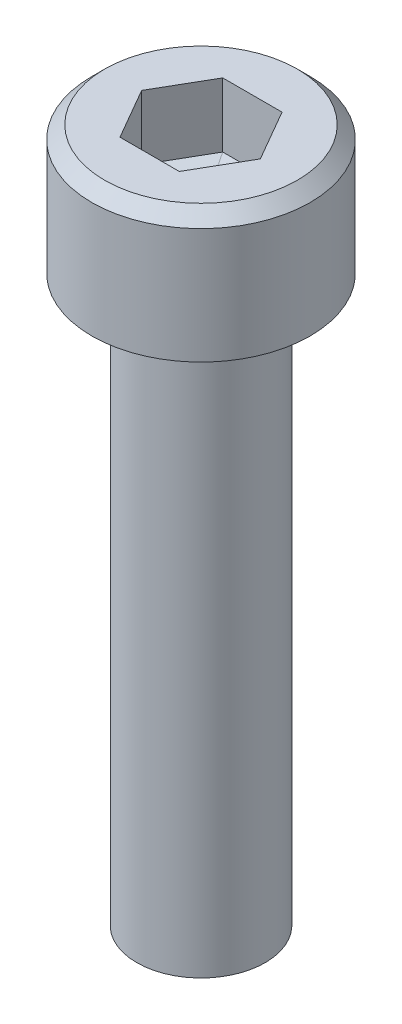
ISO-10303-21;
HEADER;
FILE_DESCRIPTION(('STEP AP214'),'2;1');
FILE_NAME('part.step','',(''),(''),'','','');
FILE_SCHEMA(('AUTOMOTIVE_DESIGN { 1 0 10303 214 1 1 1 1 }'));
ENDSEC;
DATA;
#1=APPLICATION_CONTEXT('core data for automotive mechanical design processes');
#2=APPLICATION_PROTOCOL_DEFINITION('international standard','automotive_design',2000,#1);
#3=PRODUCT_CONTEXT('',#1,'mechanical');
#4=PRODUCT('Part','Part','',(#3));
#5=PRODUCT_RELATED_PRODUCT_CATEGORY('part','',(#4));
#6=PRODUCT_DEFINITION_FORMATION('','',#4);
#7=PRODUCT_DEFINITION_CONTEXT('part definition',#1,'design');
#8=PRODUCT_DEFINITION('design','',#6,#7);
#9=PRODUCT_DEFINITION_SHAPE('','',#8);
#10=(LENGTH_UNIT() NAMED_UNIT(*) SI_UNIT(.MILLI.,.METRE.));
#11=(NAMED_UNIT(*) PLANE_ANGLE_UNIT() SI_UNIT($,.RADIAN.));
#12=(NAMED_UNIT(*) SI_UNIT($,.STERADIAN.) SOLID_ANGLE_UNIT());
#13=UNCERTAINTY_MEASURE_WITH_UNIT(LENGTH_MEASURE(1.E-05),#10,'distance_accuracy_value','');
#14=(GEOMETRIC_REPRESENTATION_CONTEXT(3) GLOBAL_UNCERTAINTY_ASSIGNED_CONTEXT((#13)) GLOBAL_UNIT_ASSIGNED_CONTEXT((#10,
#11,#12)) REPRESENTATION_CONTEXT('',''));
#15=CARTESIAN_POINT('',(0.,0.,0.));
#16=DIRECTION('',(0.,0.,1.));
#17=DIRECTION('',(1.,0.,0.));
#18=AXIS2_PLACEMENT_3D('',#15,#16,#17);
#19=CARTESIAN_POINT('',(-0.866025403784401,-2.75000000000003,0.5));
#20=DIRECTION('',(-0.210042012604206,-0.970142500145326,0.121267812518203));
#21=DIRECTION('',(0.977355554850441,-0.211603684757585,0.));
#22=AXIS2_PLACEMENT_3D('',#19,#20,#21);
#23=PLANE('',#22);
#24=DIRECTION('',(0.500000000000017,0.,0.866025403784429));
#25=VECTOR('',#24,1.);
#26=CARTESIAN_POINT('',(-2.309401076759,-2.49999999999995,0.));
#27=LINE('',#26,#25);
#28=CARTESIAN_POINT('',(-2.30940107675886,-2.49999999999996,0.));
#29=VERTEX_POINT('',#28);
#30=CARTESIAN_POINT('',(-1.15470053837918,-2.5,2.00000000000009));
#31=VERTEX_POINT('',#30);
#32=EDGE_CURVE('E106',#29,#31,#27,.T.);
#33=ORIENTED_EDGE('',*,*,#32,.T.);
#34=DIRECTION('',(0.488677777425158,-0.211603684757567,-0.846414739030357));
#35=VECTOR('',#34,1.);
#36=CARTESIAN_POINT('',(-1.15470053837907,-2.50000000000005,2.00000000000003));
#37=LINE('',#36,#35);
#38=CARTESIAN_POINT('',(0.,-3.00000000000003,0.));
#39=VERTEX_POINT('',#38);
#40=EDGE_CURVE('E105',#31,#39,#37,.T.);
#41=ORIENTED_EDGE('',*,*,#40,.T.);
#42=DIRECTION('',(0.977355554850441,-0.211603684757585,0.));
#43=VECTOR('',#42,1.);
#44=CARTESIAN_POINT('',(-0.878951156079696,-2.80970149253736,0.));
#45=LINE('',#44,#43);
#46=EDGE_CURVE('E70',#39,#29,#45,.F.);
#47=ORIENTED_EDGE('',*,*,#46,.T.);
#48=EDGE_LOOP('',(#33,#41,#47));
#49=FACE_BOUND('',#48,.T.);
#50=ADVANCED_FACE('F16',(#49),#23,.F.);
#51=CARTESIAN_POINT('',(-0.866025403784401,-2.75000000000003,-0.5));
#52=DIRECTION('',(-0.210042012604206,-0.970142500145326,-0.121267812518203));
#53=DIRECTION('',(0.977355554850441,-0.211603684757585,0.));
#54=AXIS2_PLACEMENT_3D('',#51,#52,#53);
#55=PLANE('',#54);
#56=DIRECTION('',(-0.500000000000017,0.,0.866025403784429));
#57=VECTOR('',#56,1.);
#58=CARTESIAN_POINT('',(-1.154700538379,-2.50000000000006,-2.));
#59=LINE('',#58,#57);
#60=CARTESIAN_POINT('',(-1.154700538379,-2.50000000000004,-2.));
#61=VERTEX_POINT('',#60);
#62=EDGE_CURVE('E78',#61,#29,#59,.T.);
#63=ORIENTED_EDGE('',*,*,#62,.T.);
#64=ORIENTED_EDGE('',*,*,#46,.F.);
#65=DIRECTION('',(-0.488677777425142,0.21160368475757,-0.846414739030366));
#66=VECTOR('',#65,1.);
#67=CARTESIAN_POINT('',(0.,-3.00000000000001,0.));
#68=LINE('',#67,#66);
#69=EDGE_CURVE('E75',#39,#61,#68,.T.);
#70=ORIENTED_EDGE('',*,*,#69,.T.);
#71=EDGE_LOOP('',(#63,#64,#70));
#72=FACE_BOUND('',#71,.T.);
#73=ADVANCED_FACE('F74',(#72),#55,.F.);
#74=CARTESIAN_POINT('',(0.,-2.75000000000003,-1.));
#75=DIRECTION('',(0.,-0.970142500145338,-0.242535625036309));
#76=DIRECTION('',(0.,0.242535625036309,-0.970142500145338));
#77=AXIS2_PLACEMENT_3D('',#74,#75,#76);
#78=PLANE('',#77);
#79=DIRECTION('',(1.,0.,0.));
#80=VECTOR('',#79,1.);
#81=CARTESIAN_POINT('',(1.154700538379,-2.50000000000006,-2.));
#82=LINE('',#81,#80);
#83=CARTESIAN_POINT('',(1.15470053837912,-2.50000000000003,-2.00000000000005));
#84=VERTEX_POINT('',#83);
#85=EDGE_CURVE('E87',#84,#61,#82,.F.);
#86=ORIENTED_EDGE('',*,*,#85,.T.);
#87=ORIENTED_EDGE('',*,*,#69,.F.);
#88=DIRECTION('',(0.488677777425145,0.211603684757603,-0.846414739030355));
#89=VECTOR('',#88,1.);
#90=CARTESIAN_POINT('',(0.,-3.00000000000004,0.));
#91=LINE('',#90,#89);
#92=EDGE_CURVE('E84',#39,#84,#91,.T.);
#93=ORIENTED_EDGE('',*,*,#92,.T.);
#94=EDGE_LOOP('',(#86,#87,#93));
#95=FACE_BOUND('',#94,.T.);
#96=ADVANCED_FACE('F83',(#95),#78,.F.);
#97=CARTESIAN_POINT('',(0.866025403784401,-2.75000000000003,-0.5));
#98=DIRECTION('',(0.210042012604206,-0.970142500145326,-0.121267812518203));
#99=DIRECTION('',(0.977355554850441,0.211603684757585,0.));
#100=AXIS2_PLACEMENT_3D('',#97,#98,#99);
#101=PLANE('',#100);
#102=DIRECTION('',(-0.500000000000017,0.,-0.866025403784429));
#103=VECTOR('',#102,1.);
#104=CARTESIAN_POINT('',(2.309401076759,-2.49999999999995,0.));
#105=LINE('',#104,#103);
#106=CARTESIAN_POINT('',(2.30940107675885,-2.49999999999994,0.));
#107=VERTEX_POINT('',#106);
#108=EDGE_CURVE('E95',#107,#84,#105,.T.);
#109=ORIENTED_EDGE('',*,*,#108,.T.);
#110=ORIENTED_EDGE('',*,*,#92,.F.);
#111=DIRECTION('',(0.977355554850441,0.211603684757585,0.));
#112=VECTOR('',#111,1.);
#113=CARTESIAN_POINT('',(0.878951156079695,-2.80970149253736,0.));
#114=LINE('',#113,#112);
#115=EDGE_CURVE('E92',#39,#107,#114,.T.);
#116=ORIENTED_EDGE('',*,*,#115,.T.);
#117=EDGE_LOOP('',(#109,#110,#116));
#118=FACE_BOUND('',#117,.T.);
#119=ADVANCED_FACE('F91',(#118),#101,.F.);
#120=CARTESIAN_POINT('',(0.866025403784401,-2.75000000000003,0.5));
#121=DIRECTION('',(0.210042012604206,-0.970142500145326,0.121267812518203));
#122=DIRECTION('',(0.977355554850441,0.211603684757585,0.));
#123=AXIS2_PLACEMENT_3D('',#120,#121,#122);
#124=PLANE('',#123);
#125=DIRECTION('',(0.500000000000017,0.,-0.866025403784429));
#126=VECTOR('',#125,1.);
#127=CARTESIAN_POINT('',(1.154700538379,-2.49999999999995,2.));
#128=LINE('',#127,#126);
#129=CARTESIAN_POINT('',(1.154700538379,-2.50000000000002,2.00000000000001));
#130=VERTEX_POINT('',#129);
#131=EDGE_CURVE('E102',#130,#107,#128,.T.);
#132=ORIENTED_EDGE('',*,*,#131,.T.);
#133=ORIENTED_EDGE('',*,*,#115,.F.);
#134=DIRECTION('',(0.488677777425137,0.21160368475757,0.846414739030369));
#135=VECTOR('',#134,1.);
#136=CARTESIAN_POINT('',(0.,-3.,0.));
#137=LINE('',#136,#135);
#138=EDGE_CURVE('E100',#39,#130,#137,.T.);
#139=ORIENTED_EDGE('',*,*,#138,.T.);
#140=EDGE_LOOP('',(#132,#133,#139));
#141=FACE_BOUND('',#140,.T.);
#142=ADVANCED_FACE('F98',(#141),#124,.F.);
#143=CARTESIAN_POINT('',(0.,-2.75000000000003,1.));
#144=DIRECTION('',(0.,-0.970142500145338,0.242535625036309));
#145=DIRECTION('',(0.,-0.242535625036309,-0.970142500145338));
#146=AXIS2_PLACEMENT_3D('',#143,#144,#145);
#147=PLANE('',#146);
#148=DIRECTION('',(1.,0.,0.));
#149=VECTOR('',#148,1.);
#150=CARTESIAN_POINT('',(-1.154700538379,-2.50000000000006,2.));
#151=LINE('',#150,#149);
#152=EDGE_CURVE('E112',#31,#130,#151,.T.);
#153=ORIENTED_EDGE('',*,*,#152,.T.);
#154=ORIENTED_EDGE('',*,*,#138,.F.);
#155=ORIENTED_EDGE('',*,*,#40,.F.);
#156=EDGE_LOOP('',(#153,#154,#155));
#157=FACE_BOUND('',#156,.T.);
#158=ADVANCED_FACE('F111',(#157),#147,.F.);
#159=CARTESIAN_POINT('',(-2.309401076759,0.,0.));
#160=DIRECTION('',(-0.866025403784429,0.,0.500000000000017));
#161=DIRECTION('',(0.500000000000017,0.,0.866025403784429));
#162=AXIS2_PLACEMENT_3D('',#159,#160,#161);
#163=PLANE('',#162);
#164=DIRECTION('',(0.,-1.,0.));
#165=VECTOR('',#164,1.);
#166=CARTESIAN_POINT('',(-1.15470053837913,0.,2.));
#167=LINE('',#166,#165);
#168=CARTESIAN_POINT('',(-1.15470053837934,0.,2.00000000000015));
#169=VERTEX_POINT('',#168);
#170=EDGE_CURVE('E148',#169,#31,#167,.T.);
#171=ORIENTED_EDGE('',*,*,#170,.T.);
#172=ORIENTED_EDGE('',*,*,#32,.F.);
#173=DIRECTION('',(0.,1.,0.));
#174=VECTOR('',#173,1.);
#175=CARTESIAN_POINT('',(-2.30940107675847,0.,2.84060969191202E-13));
#176=LINE('',#175,#174);
#177=CARTESIAN_POINT('',(-2.3094010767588,0.,1.47142105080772E-13));
#178=VERTEX_POINT('',#177);
#179=EDGE_CURVE('E159',#29,#178,#176,.T.);
#180=ORIENTED_EDGE('',*,*,#179,.T.);
#181=DIRECTION('',(-0.500000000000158,0.,-0.866025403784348));
#182=VECTOR('',#181,1.);
#183=CARTESIAN_POINT('',(-1.15470053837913,0.,2.00000000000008));
#184=LINE('',#183,#182);
#185=EDGE_CURVE('E143',#169,#178,#184,.T.);
#186=ORIENTED_EDGE('',*,*,#185,.F.);
#187=EDGE_LOOP('',(#171,#172,#180,#186));
#188=FACE_BOUND('',#187,.T.);
#189=ADVANCED_FACE('F164',(#188),#163,.F.);
#190=CARTESIAN_POINT('',(-1.154700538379,0.,-2.));
#191=DIRECTION('',(-0.866025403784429,0.,-0.500000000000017));
#192=DIRECTION('',(-0.500000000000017,0.,0.866025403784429));
#193=AXIS2_PLACEMENT_3D('',#190,#191,#192);
#194=PLANE('',#193);
#195=ORIENTED_EDGE('',*,*,#179,.F.);
#196=ORIENTED_EDGE('',*,*,#62,.F.);
#197=DIRECTION('',(0.,1.,0.));
#198=VECTOR('',#197,1.);
#199=CARTESIAN_POINT('',(-1.154700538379,0.,-2.));
#200=LINE('',#199,#198);
#201=CARTESIAN_POINT('',(-1.154700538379,0.,-2.));
#202=VERTEX_POINT('',#201);
#203=EDGE_CURVE('E156',#61,#202,#200,.T.);
#204=ORIENTED_EDGE('',*,*,#203,.T.);
#205=DIRECTION('',(0.500000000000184,0.,-0.866025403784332));
#206=VECTOR('',#205,1.);
#207=CARTESIAN_POINT('',(-2.30940107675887,0.,0.));
#208=LINE('',#207,#206);
#209=EDGE_CURVE('E140',#178,#202,#208,.T.);
#210=ORIENTED_EDGE('',*,*,#209,.F.);
#211=EDGE_LOOP('',(#195,#196,#204,#210));
#212=FACE_BOUND('',#211,.T.);
#213=ADVANCED_FACE('F167',(#212),#194,.F.);
#214=CARTESIAN_POINT('',(1.154700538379,0.,-2.));
#215=DIRECTION('',(0.,0.,-1.));
#216=DIRECTION('',(0.,1.,0.));
#217=AXIS2_PLACEMENT_3D('',#214,#215,#216);
#218=PLANE('',#217);
#219=ORIENTED_EDGE('',*,*,#203,.F.);
#220=ORIENTED_EDGE('',*,*,#85,.F.);
#221=DIRECTION('',(0.,1.,0.));
#222=VECTOR('',#221,1.);
#223=CARTESIAN_POINT('',(1.15470053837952,0.,-2.00000000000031));
#224=LINE('',#223,#222);
#225=CARTESIAN_POINT('',(1.15470053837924,0.,-2.00000000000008));
#226=VERTEX_POINT('',#225);
#227=EDGE_CURVE('E153',#84,#226,#224,.T.);
#228=ORIENTED_EDGE('',*,*,#227,.T.);
#229=DIRECTION('',(1.,0.,0.));
#230=VECTOR('',#229,1.);
#231=CARTESIAN_POINT('',(0.,0.,-2.));
#232=LINE('',#231,#230);
#233=EDGE_CURVE('E137',#202,#226,#232,.T.);
#234=ORIENTED_EDGE('',*,*,#233,.F.);
#235=EDGE_LOOP('',(#219,#220,#228,#234));
#236=FACE_BOUND('',#235,.T.);
#237=ADVANCED_FACE('F266',(#236),#218,.F.);
#238=CARTESIAN_POINT('',(2.309401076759,0.,0.));
#239=DIRECTION('',(0.866025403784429,0.,-0.500000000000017));
#240=DIRECTION('',(-0.500000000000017,0.,-0.866025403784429));
#241=AXIS2_PLACEMENT_3D('',#238,#239,#240);
#242=PLANE('',#241);
#243=ORIENTED_EDGE('',*,*,#227,.F.);
#244=ORIENTED_EDGE('',*,*,#108,.F.);
#245=DIRECTION('',(0.,1.,0.));
#246=VECTOR('',#245,1.);
#247=CARTESIAN_POINT('',(2.30940107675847,0.,-2.89265139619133E-13));
#248=LINE('',#247,#246);
#249=CARTESIAN_POINT('',(2.3094010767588,0.,-1.48443147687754E-13));
#250=VERTEX_POINT('',#249);
#251=EDGE_CURVE('E150',#107,#250,#248,.T.);
#252=ORIENTED_EDGE('',*,*,#251,.T.);
#253=DIRECTION('',(0.500000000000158,0.,0.866025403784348));
#254=VECTOR('',#253,1.);
#255=CARTESIAN_POINT('',(1.15470053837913,0.,-2.00000000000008));
#256=LINE('',#255,#254);
#257=EDGE_CURVE('E134',#226,#250,#256,.T.);
#258=ORIENTED_EDGE('',*,*,#257,.F.);
#259=EDGE_LOOP('',(#243,#244,#252,#258));
#260=FACE_BOUND('',#259,.T.);
#261=ADVANCED_FACE('F185',(#260),#242,.F.);
#262=CARTESIAN_POINT('',(1.154700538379,0.,2.));
#263=DIRECTION('',(0.866025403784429,0.,0.500000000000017));
#264=DIRECTION('',(0.500000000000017,0.,-0.866025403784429));
#265=AXIS2_PLACEMENT_3D('',#262,#263,#264);
#266=PLANE('',#265);
#267=ORIENTED_EDGE('',*,*,#251,.F.);
#268=ORIENTED_EDGE('',*,*,#131,.F.);
#269=DIRECTION('',(0.,-1.,0.));
#270=VECTOR('',#269,1.);
#271=CARTESIAN_POINT('',(1.154700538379,0.,2.));
#272=LINE('',#271,#270);
#273=CARTESIAN_POINT('',(1.154700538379,0.,2.));
#274=VERTEX_POINT('',#273);
#275=EDGE_CURVE('E34',#130,#274,#272,.F.);
#276=ORIENTED_EDGE('',*,*,#275,.T.);
#277=DIRECTION('',(-0.500000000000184,0.,0.866025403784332));
#278=VECTOR('',#277,1.);
#279=CARTESIAN_POINT('',(2.30940107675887,0.,0.));
#280=LINE('',#279,#278);
#281=EDGE_CURVE('E131',#250,#274,#280,.T.);
#282=ORIENTED_EDGE('',*,*,#281,.F.);
#283=EDGE_LOOP('',(#267,#268,#276,#282));
#284=FACE_BOUND('',#283,.T.);
#285=ADVANCED_FACE('F175',(#284),#266,.F.);
#286=CARTESIAN_POINT('',(-1.154700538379,0.,2.));
#287=DIRECTION('',(0.,0.,1.));
#288=DIRECTION('',(0.,-1.,0.));
#289=AXIS2_PLACEMENT_3D('',#286,#287,#288);
#290=PLANE('',#289);
#291=ORIENTED_EDGE('',*,*,#275,.F.);
#292=ORIENTED_EDGE('',*,*,#152,.F.);
#293=ORIENTED_EDGE('',*,*,#170,.F.);
#294=DIRECTION('',(1.,0.,0.));
#295=VECTOR('',#294,1.);
#296=CARTESIAN_POINT('',(0.,0.,2.));
#297=LINE('',#296,#295);
#298=EDGE_CURVE('E127',#274,#169,#297,.F.);
#299=ORIENTED_EDGE('',*,*,#298,.F.);
#300=EDGE_LOOP('',(#291,#292,#293,#299));
#301=FACE_BOUND('',#300,.T.);
#302=ADVANCED_FACE('F173',(#301),#290,.F.);
#303=CARTESIAN_POINT('',(0.,0.,0.));
#304=DIRECTION('',(0.,1.,0.));
#305=DIRECTION('',(0.,0.,1.));
#306=AXIS2_PLACEMENT_3D('',#303,#304,#305);
#307=PLANE('',#306);
#308=CARTESIAN_POINT('',(0.,0.,0.));
#309=DIRECTION('',(0.,-1.,0.));
#310=DIRECTION('',(0.,0.,-1.));
#311=AXIS2_PLACEMENT_3D('',#308,#309,#310);
#312=CIRCLE('',#311,3.75000000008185);
#313=CARTESIAN_POINT('',(0.,0.,-3.75000000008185));
#314=VERTEX_POINT('',#313);
#315=EDGE_CURVE('E19',#314,#314,#312,.T.);
#316=ORIENTED_EDGE('',*,*,#315,.F.);
#317=EDGE_LOOP('',(#316));
#318=FACE_BOUND('',#317,.T.);
#319=ORIENTED_EDGE('',*,*,#281,.T.);
#320=ORIENTED_EDGE('',*,*,#298,.T.);
#321=ORIENTED_EDGE('',*,*,#185,.T.);
#322=ORIENTED_EDGE('',*,*,#209,.T.);
#323=ORIENTED_EDGE('',*,*,#233,.T.);
#324=ORIENTED_EDGE('',*,*,#257,.T.);
#325=EDGE_LOOP('',(#319,#320,#321,#322,#323,#324));
#326=FACE_BOUND('',#325,.T.);
#327=ADVANCED_FACE('F171',(#318,#326),#307,.T.);
#328=CARTESIAN_POINT('',(0.,-0.49999999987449,0.));
#329=DIRECTION('',(0.,-1.,0.));
#330=DIRECTION('',(0.,0.,-1.));
#331=AXIS2_PLACEMENT_3D('',#328,#329,#330);
#332=CONICAL_SURFACE('',#331,4.2499999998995,0.785398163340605);
#333=CARTESIAN_POINT('',(0.,-0.500000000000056,0.));
#334=DIRECTION('',(0.,1.,0.));
#335=DIRECTION('',(0.,0.,1.));
#336=AXIS2_PLACEMENT_3D('',#333,#334,#335);
#337=CIRCLE('',#336,4.25);
#338=CARTESIAN_POINT('',(0.,-0.500000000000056,4.25));
#339=VERTEX_POINT('',#338);
#340=EDGE_CURVE('E119',#339,#339,#337,.F.);
#341=ORIENTED_EDGE('',*,*,#340,.F.);
#342=EDGE_LOOP('',(#341));
#343=FACE_BOUND('',#342,.T.);
#344=ORIENTED_EDGE('',*,*,#315,.T.);
#345=EDGE_LOOP('',(#344));
#346=FACE_BOUND('',#345,.T.);
#347=ADVANCED_FACE('F182',(#343,#346),#332,.T.);
#348=CARTESIAN_POINT('',(0.,-28.35,0.));
#349=DIRECTION('',(0.,1.,0.));
#350=DIRECTION('',(0.,0.,1.));
#351=AXIS2_PLACEMENT_3D('',#348,#349,#350);
#352=CYLINDRICAL_SURFACE('',#351,4.25);
#353=ORIENTED_EDGE('',*,*,#340,.T.);
#354=EDGE_LOOP('',(#353));
#355=FACE_BOUND('',#354,.T.);
#356=CARTESIAN_POINT('',(0.,-5.,0.));
#357=DIRECTION('',(0.,1.,0.));
#358=DIRECTION('',(0.,0.,1.));
#359=AXIS2_PLACEMENT_3D('',#356,#357,#358);
#360=CIRCLE('',#359,4.25);
#361=CARTESIAN_POINT('',(0.,-5.,4.25));
#362=VERTEX_POINT('',#361);
#363=EDGE_CURVE('E117',#362,#362,#360,.T.);
#364=ORIENTED_EDGE('',*,*,#363,.T.);
#365=EDGE_LOOP('',(#364));
#366=FACE_BOUND('',#365,.T.);
#367=ADVANCED_FACE('F202',(#355,#366),#352,.T.);
#368=CARTESIAN_POINT('',(0.,-27.,0.));
#369=DIRECTION('',(0.,1.,0.));
#370=DIRECTION('',(0.,0.,1.));
#371=AXIS2_PLACEMENT_3D('',#368,#369,#370);
#372=PLANE('',#371);
#373=CARTESIAN_POINT('',(0.,-27.,0.));
#374=DIRECTION('',(0.,1.,0.));
#375=DIRECTION('',(0.,0.,1.));
#376=AXIS2_PLACEMENT_3D('',#373,#374,#375);
#377=CIRCLE('',#376,2.5);
#378=CARTESIAN_POINT('',(0.,-27.,2.5));
#379=VERTEX_POINT('',#378);
#380=EDGE_CURVE('E25',#379,#379,#377,.T.);
#381=ORIENTED_EDGE('',*,*,#380,.F.);
#382=EDGE_LOOP('',(#381));
#383=FACE_BOUND('',#382,.T.);
#384=ADVANCED_FACE('F195',(#383),#372,.F.);
#385=CARTESIAN_POINT('',(0.,-5.,0.));
#386=DIRECTION('',(0.,1.,0.));
#387=DIRECTION('',(0.,0.,1.));
#388=AXIS2_PLACEMENT_3D('',#385,#386,#387);
#389=PLANE('',#388);
#390=ORIENTED_EDGE('',*,*,#363,.F.);
#391=EDGE_LOOP('',(#390));
#392=FACE_BOUND('',#391,.T.);
#393=CARTESIAN_POINT('',(0.,-5.,0.));
#394=DIRECTION('',(0.,1.,0.));
#395=DIRECTION('',(0.,0.,1.));
#396=AXIS2_PLACEMENT_3D('',#393,#394,#395);
#397=CIRCLE('',#396,2.5);
#398=CARTESIAN_POINT('',(0.,-5.,2.5));
#399=VERTEX_POINT('',#398);
#400=EDGE_CURVE('E11',#399,#399,#397,.F.);
#401=ORIENTED_EDGE('',*,*,#400,.F.);
#402=EDGE_LOOP('',(#401));
#403=FACE_BOUND('',#402,.T.);
#404=ADVANCED_FACE('F189',(#392,#403),#389,.F.);
#405=CARTESIAN_POINT('',(0.,-28.35,0.));
#406=DIRECTION('',(0.,1.,0.));
#407=DIRECTION('',(0.,0.,1.));
#408=AXIS2_PLACEMENT_3D('',#405,#406,#407);
#409=CYLINDRICAL_SURFACE('',#408,2.5);
#410=ORIENTED_EDGE('',*,*,#400,.T.);
#411=EDGE_LOOP('',(#410));
#412=FACE_BOUND('',#411,.T.);
#413=ORIENTED_EDGE('',*,*,#380,.T.);
#414=EDGE_LOOP('',(#413));
#415=FACE_BOUND('',#414,.T.);
#416=ADVANCED_FACE('F187',(#412,#415),#409,.T.);
#417=CLOSED_SHELL('',(#50,#73,#96,#119,#142,#158,#189,#213,#237,#261,#285,#302,#327,#347,#367,
#384,#404,#416));
#418=MANIFOLD_SOLID_BREP('B1',#417);
#419=ADVANCED_BREP_SHAPE_REPRESENTATION('',(#18,#418),#14);
#420=SHAPE_DEFINITION_REPRESENTATION(#9,#419);
ENDSEC;
END-ISO-10303-21;
